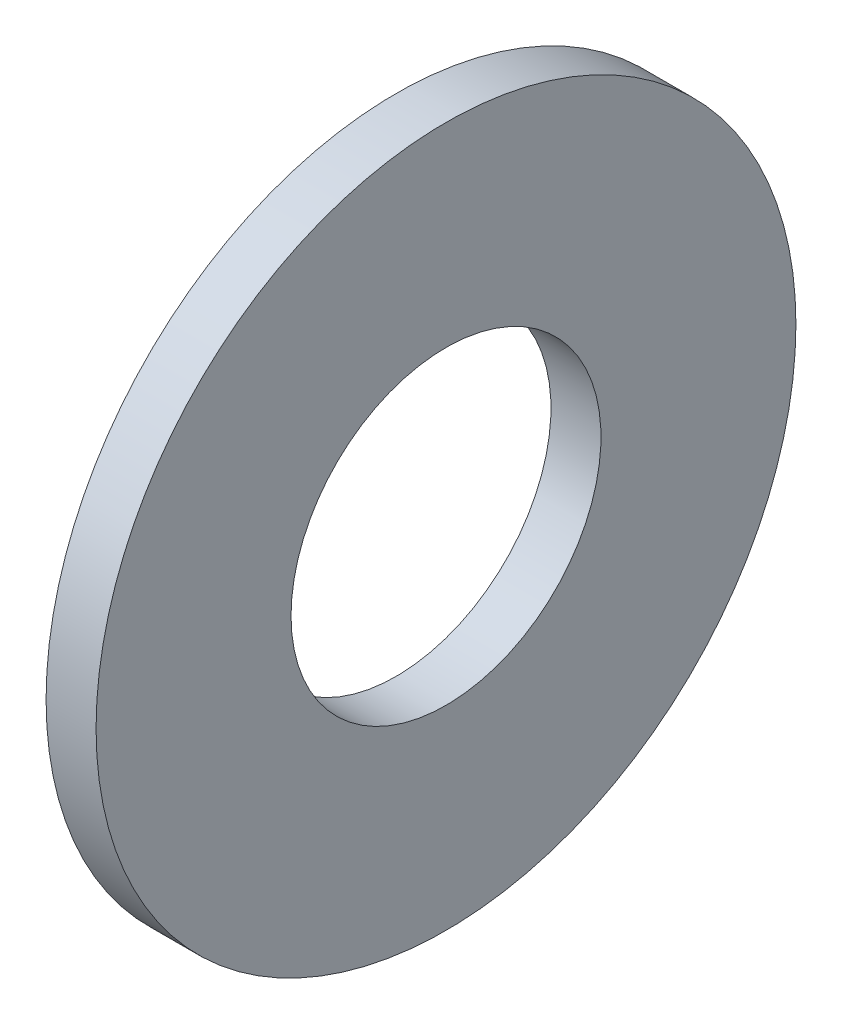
ISO-10303-21;
HEADER;
FILE_DESCRIPTION(('STEP AP214'),'2;1');
FILE_NAME('part.step','',(''),(''),'','','');
FILE_SCHEMA(('AUTOMOTIVE_DESIGN { 1 0 10303 214 1 1 1 1 }'));
ENDSEC;
DATA;
#1=APPLICATION_CONTEXT('core data for automotive mechanical design processes');
#2=APPLICATION_PROTOCOL_DEFINITION('international standard','automotive_design',2000,#1);
#3=PRODUCT_CONTEXT('',#1,'mechanical');
#4=PRODUCT('Part','Part','',(#3));
#5=PRODUCT_RELATED_PRODUCT_CATEGORY('part','',(#4));
#6=PRODUCT_DEFINITION_FORMATION('','',#4);
#7=PRODUCT_DEFINITION_CONTEXT('part definition',#1,'design');
#8=PRODUCT_DEFINITION('design','',#6,#7);
#9=PRODUCT_DEFINITION_SHAPE('','',#8);
#10=(LENGTH_UNIT() NAMED_UNIT(*) SI_UNIT(.MILLI.,.METRE.));
#11=(NAMED_UNIT(*) PLANE_ANGLE_UNIT() SI_UNIT($,.RADIAN.));
#12=(NAMED_UNIT(*) SI_UNIT($,.STERADIAN.) SOLID_ANGLE_UNIT());
#13=UNCERTAINTY_MEASURE_WITH_UNIT(LENGTH_MEASURE(1.E-05),#10,'distance_accuracy_value','');
#14=(GEOMETRIC_REPRESENTATION_CONTEXT(3) GLOBAL_UNCERTAINTY_ASSIGNED_CONTEXT((#13)) GLOBAL_UNIT_ASSIGNED_CONTEXT((#10,
#11,#12)) REPRESENTATION_CONTEXT('',''));
#15=CARTESIAN_POINT('',(0.,0.,0.));
#16=DIRECTION('',(0.,0.,1.));
#17=DIRECTION('',(1.,0.,0.));
#18=AXIS2_PLACEMENT_3D('',#15,#16,#17);
#19=CARTESIAN_POINT('',(0.,3.1,0.));
#20=DIRECTION('',(1.,0.,0.));
#21=DIRECTION('',(0.,0.,-1.));
#22=AXIS2_PLACEMENT_3D('',#19,#20,#21);
#23=PLANE('',#22);
#24=CARTESIAN_POINT('',(0.,0.,0.));
#25=DIRECTION('',(-1.,0.,0.));
#26=DIRECTION('',(0.,0.,1.));
#27=AXIS2_PLACEMENT_3D('',#24,#25,#26);
#28=CIRCLE('',#27,3.1);
#29=CARTESIAN_POINT('',(0.,0.,3.1));
#30=VERTEX_POINT('',#29);
#31=EDGE_CURVE('E47',#30,#30,#28,.T.);
#32=ORIENTED_EDGE('',*,*,#31,.F.);
#33=EDGE_LOOP('',(#32));
#34=FACE_BOUND('',#33,.T.);
#35=CARTESIAN_POINT('',(0.,0.,0.));
#36=DIRECTION('',(-1.,0.,0.));
#37=DIRECTION('',(0.,0.,1.));
#38=AXIS2_PLACEMENT_3D('',#35,#36,#37);
#39=CIRCLE('',#38,7.);
#40=CARTESIAN_POINT('',(0.,0.,7.));
#41=VERTEX_POINT('',#40);
#42=EDGE_CURVE('E10',#41,#41,#39,.T.);
#43=ORIENTED_EDGE('',*,*,#42,.T.);
#44=EDGE_LOOP('',(#43));
#45=FACE_BOUND('',#44,.T.);
#46=ADVANCED_FACE('F33',(#34,#45),#23,.F.);
#47=CARTESIAN_POINT('',(-33.3805605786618,0.,0.));
#48=DIRECTION('',(-1.,0.,0.));
#49=DIRECTION('',(0.,0.,1.));
#50=AXIS2_PLACEMENT_3D('',#47,#48,#49);
#51=CYLINDRICAL_SURFACE('',#50,7.);
#52=ORIENTED_EDGE('',*,*,#42,.F.);
#53=EDGE_LOOP('',(#52));
#54=FACE_BOUND('',#53,.T.);
#55=CARTESIAN_POINT('',(1.,0.,0.));
#56=DIRECTION('',(-1.,0.,0.));
#57=DIRECTION('',(0.,0.,1.));
#58=AXIS2_PLACEMENT_3D('',#55,#56,#57);
#59=CIRCLE('',#58,7.);
#60=CARTESIAN_POINT('',(1.,0.,7.));
#61=VERTEX_POINT('',#60);
#62=EDGE_CURVE('E39',#61,#61,#59,.T.);
#63=ORIENTED_EDGE('',*,*,#62,.T.);
#64=EDGE_LOOP('',(#63));
#65=FACE_BOUND('',#64,.T.);
#66=ADVANCED_FACE('F56',(#54,#65),#51,.T.);
#67=CARTESIAN_POINT('',(1.,3.1,0.));
#68=DIRECTION('',(-1.,0.,0.));
#69=DIRECTION('',(0.,0.,1.));
#70=AXIS2_PLACEMENT_3D('',#67,#68,#69);
#71=PLANE('',#70);
#72=ORIENTED_EDGE('',*,*,#62,.F.);
#73=EDGE_LOOP('',(#72));
#74=FACE_BOUND('',#73,.T.);
#75=CARTESIAN_POINT('',(1.,0.,0.));
#76=DIRECTION('',(-1.,0.,0.));
#77=DIRECTION('',(0.,0.,1.));
#78=AXIS2_PLACEMENT_3D('',#75,#76,#77);
#79=CIRCLE('',#78,3.1);
#80=CARTESIAN_POINT('',(1.,0.,3.1));
#81=VERTEX_POINT('',#80);
#82=EDGE_CURVE('E43',#81,#81,#79,.T.);
#83=ORIENTED_EDGE('',*,*,#82,.T.);
#84=EDGE_LOOP('',(#83));
#85=FACE_BOUND('',#84,.T.);
#86=ADVANCED_FACE('F60',(#74,#85),#71,.F.);
#87=CARTESIAN_POINT('',(-33.3805605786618,0.,0.));
#88=DIRECTION('',(-1.,0.,0.));
#89=DIRECTION('',(0.,0.,1.));
#90=AXIS2_PLACEMENT_3D('',#87,#88,#89);
#91=CYLINDRICAL_SURFACE('',#90,3.1);
#92=ORIENTED_EDGE('',*,*,#82,.F.);
#93=EDGE_LOOP('',(#92));
#94=FACE_BOUND('',#93,.T.);
#95=ORIENTED_EDGE('',*,*,#31,.T.);
#96=EDGE_LOOP('',(#95));
#97=FACE_BOUND('',#96,.T.);
#98=ADVANCED_FACE('F53',(#94,#97),#91,.F.);
#99=CLOSED_SHELL('',(#46,#66,#86,#98));
#100=MANIFOLD_SOLID_BREP('B2',#99);
#101=ADVANCED_BREP_SHAPE_REPRESENTATION('',(#18,#100),#14);
#102=SHAPE_DEFINITION_REPRESENTATION(#9,#101);
ENDSEC;
END-ISO-10303-21;
